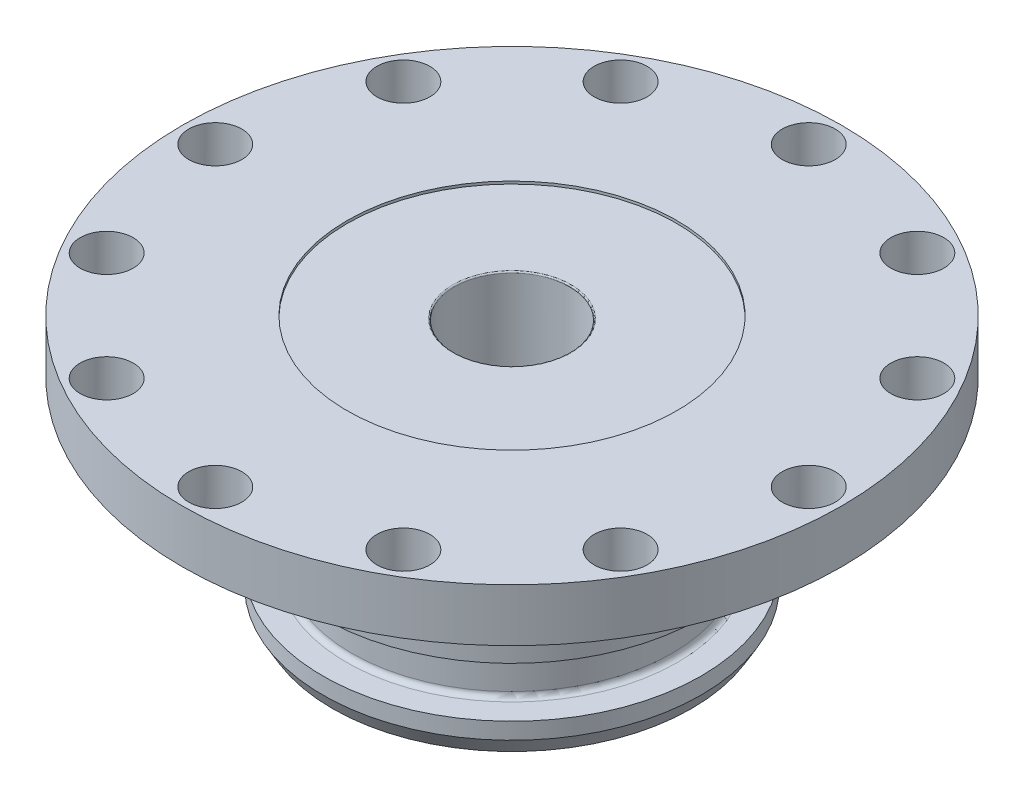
from build123d import *

# Parameters (mm, degrees)
F_10_CLEARANCE_HOLE1_D   = 5.1054
SKETCH5_R                = 15.875
CUT_EXTRUDE2_DEPTH       = 0.254
FILLET1_R                = 0.508
CHAMFER1_SIZE            = 1.5875
CHAMFER1_SIZE2           = 0.916543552
F_7_16_20_TAPPED_HOLE1_D = 11.1125
FILLET2_R                = 0.127


with BuildPart() as part:
    # Sketch1 → Revolve1 (revolve)
    with BuildSketch(Plane.XY, mode=Mode.PRIVATE) as revolve1_sk:
        with BuildLine():
            Line((0, 0), (18.2118, 0))
            Line((18.2118, 0), (18.2118, 3.175))
            Line((18.2118, 3.175), (15.4305, 3.175))
            Line((15.4305, 3.175), (15.4305, 8.001))
            Line((15.4305, 8.001), (18.2118, 8.001))
            Line((18.2118, 8.001), (18.2118, 11.176))
            Line((18.2118, 11.176), (15.4305, 11.176))
            Line((15.4305, 11.176), (15.4305, 16.002))
            Line((15.4305, 16.002), (18.2118, 16.002))
            Line((18.2118, 16.002), (18.2118, 18.25625))
            ThreePointArc((18.2118, 18.25625), (18.444283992, 18.817516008), (19.00555, 19.05))
            Line((19.00555, 19.05), (31.75, 19.05))
            Line((31.75, 19.05), (31.75, 24.13))
            Line((31.75, 24.13), (0, 24.13))
            Line((0, 24.13), (0, 0))
        make_face()
    revolve(revolve1_sk.sketch.rotate(Axis((0, 0, 0), (0, -1, 0)), 180), axis=Axis((0, 0, 0), (0, -1, 0)))

    # 10 Clearance Hole1 (through all)
    with Locations(Plane(origin=(0, 24.13, 0), x_dir=(1, 0, 0), z_dir=(0, 1, 0))):
        with Locations((0, 28.575), (14.2875, 24.746675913), (24.746675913, 14.2875), (28.575, 0), (24.746675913, -14.2875), (14.2875, -24.746675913), (0, -28.575), (-14.2875, -24.746675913), (-24.746675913, -14.2875), (-28.575, 0), (-24.746675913, 14.2875), (-14.2875, 24.746675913)):
            Hole(F_10_CLEARANCE_HOLE1_D / 2)

    # Sketch5 → Cut-Extrude2 (cut)
    with BuildSketch(Plane(origin=(0, 24.13, 0), x_dir=(1, 0, 0), z_dir=(0, 1, 0))):
        with Locations(Location((0, 0, 0), (0, 0, 180))):
            Circle(SKETCH5_R)
    extrude(amount=-CUT_EXTRUDE2_DEPTH, mode=Mode.SUBTRACT)

    # Fillet1
    fillet1_edges = [part.edges().sort_by_distance(p)[0] for p in [
        (15.4305, 3.175, 0),
        (15.4305, 8.001, 0),
        (15.4305, 11.176, 0),
        (15.4305, 16.002, 0),
    ]]
    fillet(fillet1_edges, radius=FILLET1_R)

    # Chamfer1
    chamfer1_edges = [part.edges().sort_by_distance(p)[0] for p in [
        (18.2118, 0, 0),
    ]]
    chamfer1_side = [part.faces().sort_by_distance(p)[0] for p in [
        (18.2118, 1.5875, 0),
    ]]
    chamfer(chamfer1_edges, length=CHAMFER1_SIZE, length2=CHAMFER1_SIZE2, reference=chamfer1_side[0])

    # 7_16-20 Tapped Hole1 (through all)
    with Locations(Plane(origin=(0, 24.13, 0), x_dir=(1, 0, 0), z_dir=(0, 1, 0))):
        with Locations((0, 0)):
            Hole(F_7_16_20_TAPPED_HOLE1_D / 2)

    # Fillet2
    fillet2_edges = [part.edges().sort_by_distance(p)[0] for p in [
        (5.55625, 23.876, 0),
    ]]
    fillet(fillet2_edges, radius=FILLET2_R)


solid = part.part
